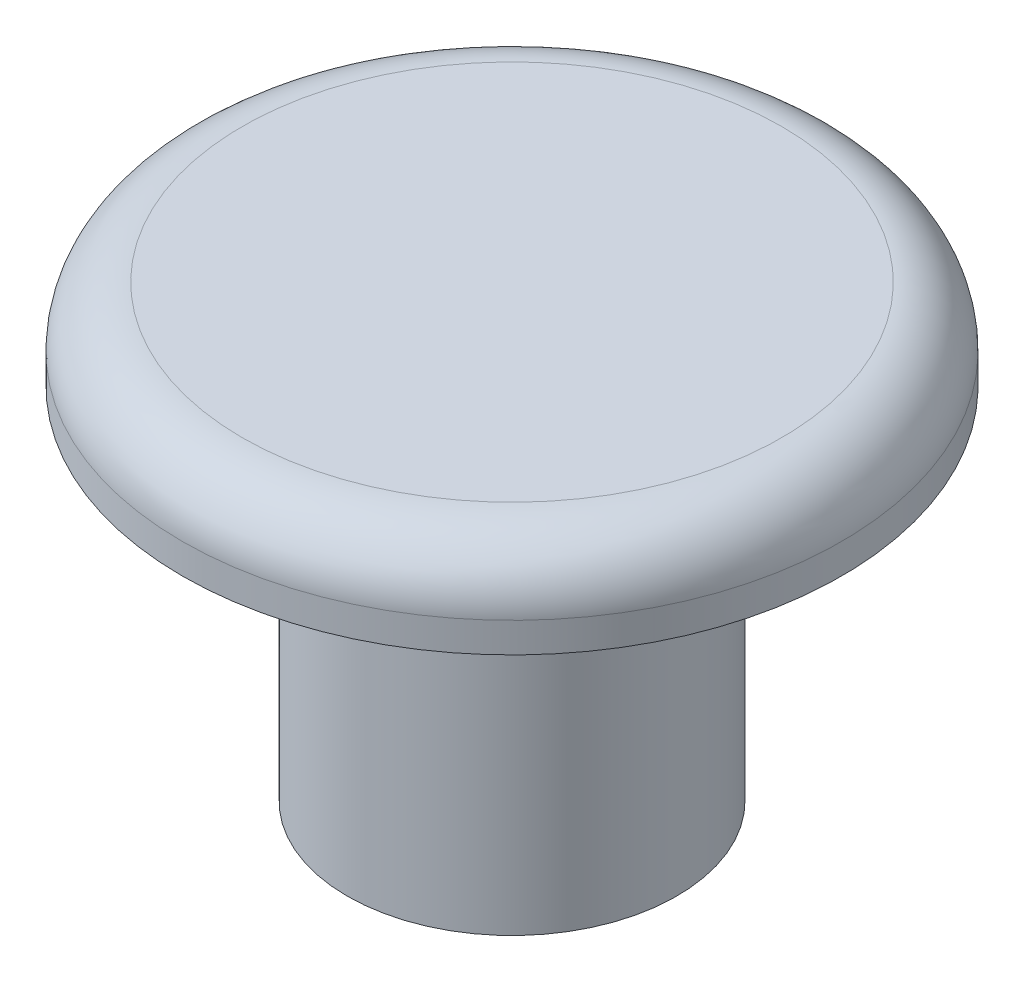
from build123d import *

# Parameters (mm, degrees)
SKETCH1_R           = 5.5
BOSS_EXTRUDE1_DEPTH = 12
SKETCH2_R           = 11
BOSS_EXTRUDE2_DEPTH = 3
FILLET1_R           = 2


with BuildPart() as part:
    # Sketch1 → Boss-Extrude1 (new body)
    with BuildSketch(Plane(origin=(0, 0, 0), x_dir=(1, 0, 0), z_dir=(0, 1, 0))):
        with Locations(Location((0, 0, 0), (0, 0, 270))):
            Circle(SKETCH1_R)
    extrude(amount=BOSS_EXTRUDE1_DEPTH)

    # Sketch2 → Boss-Extrude2 (add)
    with BuildSketch(Plane(origin=(0, 12, 0), x_dir=(1, 0, 0), z_dir=(0, 1, 0))):
        with Locations(Location((0, 0, 0), (0, 0, 270))):
            Circle(SKETCH2_R)
    extrude(amount=BOSS_EXTRUDE2_DEPTH)

    # Fillet1
    fillet1_edges = [part.edges().sort_by_distance(p)[0] for p in [
        (0, 15, -11),
    ]]
    fillet(fillet1_edges, radius=FILLET1_R)


solid = part.part
